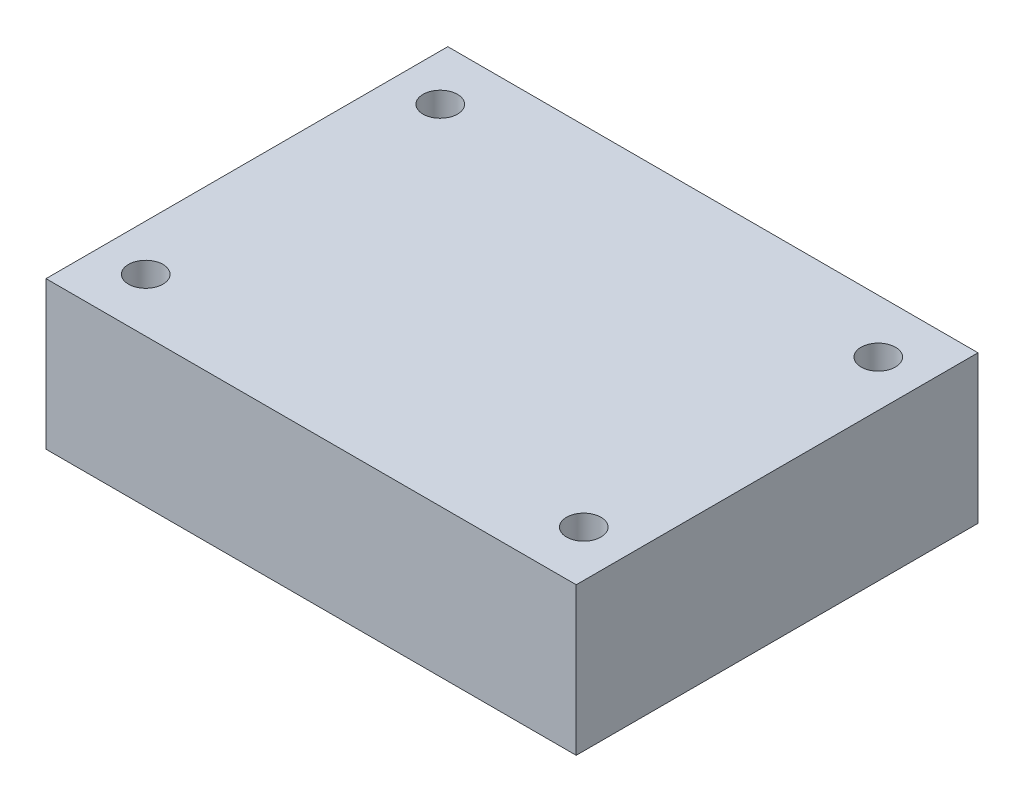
from build123d import *

# Parameters (mm, degrees)
SKETCH1_W           = 146.75472848
SKETCH1_H           = 111.211069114
BOSS_EXTRUDE1_DEPTH = 40.894
SKETCH2_R           = 4.7625
CUT_EXTRUDE1_DEPTH  = 101.739924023


with BuildPart() as part:
    # Sketch1 → Boss-Extrude1 (new body)
    with BuildSketch(Plane(origin=(0, 0, 0), x_dir=(1, 0, 0), z_dir=(0, 1, 0))):
        Rectangle(SKETCH1_W, SKETCH1_H)
    extrude(amount=BOSS_EXTRUDE1_DEPTH)

    # Sketch2 → Cut-Extrude1 (cut, through all)
    with BuildSketch(Plane(origin=(0, 40.894, 0), x_dir=(1, 0, 0), z_dir=(0, 1, 0))):
        with Locations(Location((-60.617854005, 40.760409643, 0), (0, 0, 270))):
            Circle(SKETCH2_R)
        with Locations(Location((60.617854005, 40.760409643, 0), (0, 0, 90))):
            Circle(SKETCH2_R)
        with Locations(Location((-60.617854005, -40.760409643, 0), (0, 0, 90))):
            Circle(SKETCH2_R)
        with Locations(Location((60.617854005, -40.760409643, 0), (0, 0, 270))):
            Circle(SKETCH2_R)
    extrude(amount=-CUT_EXTRUDE1_DEPTH, mode=Mode.SUBTRACT)


solid = part.part
